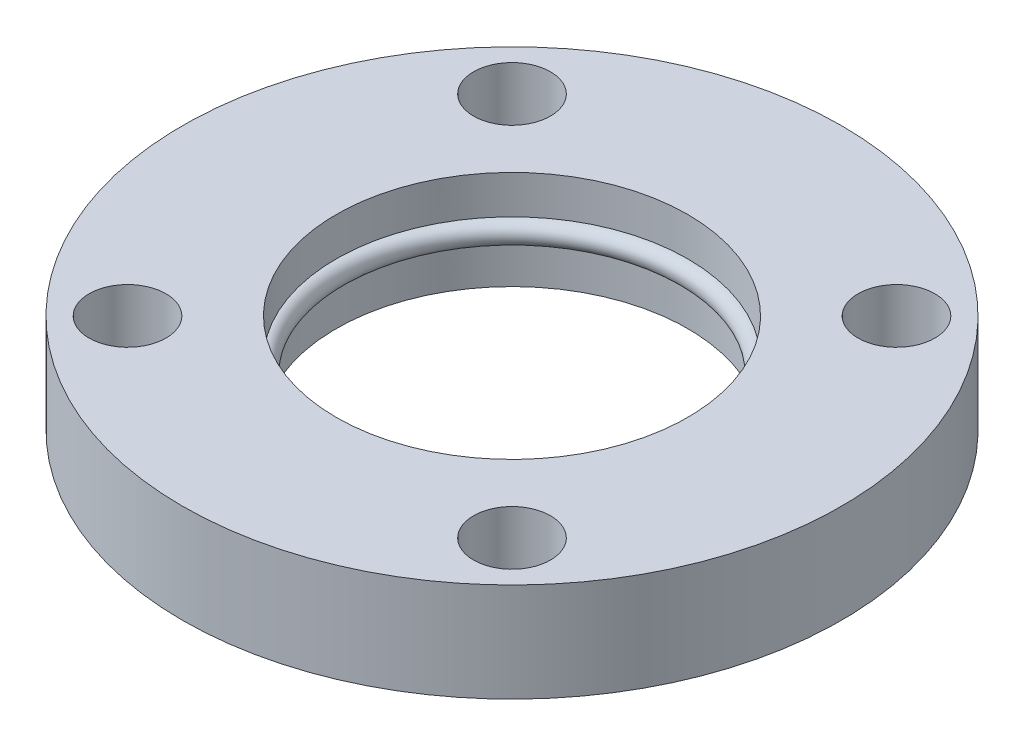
from build123d import *

# Parameters (mm, degrees)
SKETCH2_R           = 30
SKETCH2_R_2         = 16
SKETCH2_R_3         = 3.5
BOSS_EXTRUDE1_DEPTH = 4.5
SKETCH3_R           = 1


with BuildPart() as part:
    # Sketch2 → Boss-Extrude1 (new, symmetric)
    with BuildSketch(Plane(origin=(0, 0, 0), x_dir=(1, 0, 0), z_dir=(0, 1, 0))):
        with Locations(Location((0, 0, 0), (0, 0, 270))):
            Circle(SKETCH2_R)
        with Locations(Location((0, 0, 0), (0, 0, 270))):
            Circle(SKETCH2_R_2, mode=Mode.SUBTRACT)
        with Locations(Location((-17.5, 17.5, 0), (0, 0, 270))):
            Circle(SKETCH2_R_3, mode=Mode.SUBTRACT)
        with Locations(Location((17.5, 17.5, 0), (0, 0, 270))):
            Circle(SKETCH2_R_3, mode=Mode.SUBTRACT)
        with Locations(Location((17.5, -17.5, 0), (0, 0, 270))):
            Circle(SKETCH2_R_3, mode=Mode.SUBTRACT)
        with Locations(Location((-17.5, -17.5, 0), (0, 0, 270))):
            Circle(SKETCH2_R_3, mode=Mode.SUBTRACT)
    extrude(amount=BOSS_EXTRUDE1_DEPTH, both=True)

    # Sketch3 → Revolve2 (revolve)
    with BuildSketch(Plane.XY, mode=Mode.PRIVATE) as revolve2_sk:
        with Locations((-16, 0)):
            Circle(SKETCH3_R)
    revolve(revolve2_sk.sketch.rotate(Axis((0, 0, 0), (0, 1, 0)), 270), axis=Axis((0, 0, 0), (0, 1, 0)))


solid = part.part
